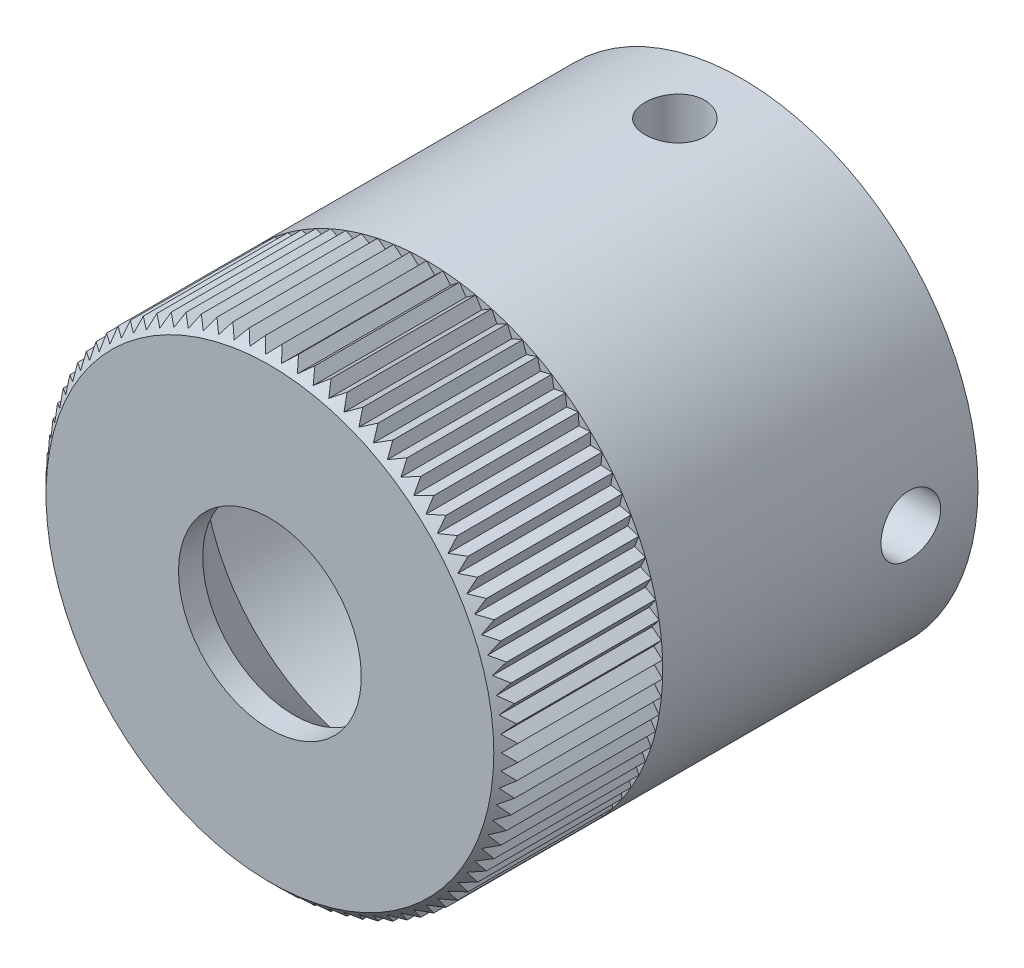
from build123d import *

# Parameters (mm, degrees)
SKETCH1_R           = 6.325
BOSS_EXTRUDE1_DEPTH = 12.65
SKETCH2_R           = 4.8
CUT_EXTRUDE1_DEPTH  = 9.65
SKETCH3_R           = 2.45
CUT_EXTRUDE2_DEPTH  = 14.158029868
CUT_EXTRUDE4_DEPTH  = 4.2
CIRPATTERN1_COUNT   = 90
CHAMFER1_SIZE       = 0.5
SKETCH6_R           = 0.8
CUT_EXTRUDE5_DEPTH  = 16.493022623
CIRPATTERN2_COUNT   = 2
CIRPATTERN2_ANGLE   = 90
SKETCH10_OUTSIDE_W  = 52.018
SKETCH10_OUTSIDE_H  = 52.018
SKETCH10_OUTSIDE_R  = 6
CUT_EXTRUDE7_DEPTH  = 16.493022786
CUT_EXTRUDE7_DRAFT  = -45


with BuildPart() as part:
    # Sketch1 → Boss-Extrude1 (new body)
    with BuildSketch(Plane.XY):
        Circle(SKETCH1_R)
    extrude(amount=BOSS_EXTRUDE1_DEPTH)

    # Sketch2 → Cut-Extrude1 (cut)
    with BuildSketch(Plane(origin=(0, 0, 0), x_dir=(-1, 0, 0), z_dir=(0, 0, -1))):
        Circle(SKETCH2_R)
    extrude(amount=-CUT_EXTRUDE1_DEPTH, mode=Mode.SUBTRACT)

    # Sketch3 → Cut-Extrude2 (cut, through all)
    with BuildSketch(Plane(origin=(0, 0, 9.65), x_dir=(-1, 0, 0), z_dir=(0, 0, -1))):
        Circle(SKETCH3_R)
    extrude(amount=-CUT_EXTRUDE2_DEPTH, mode=Mode.SUBTRACT)

    # Cut-Extrude3 cone 1 section (on through the dimple's axis) → Cut-Extrude3 (revolve, cut)
    with BuildSketch(Plane(origin=(0, 0, 9.65), x_dir=(0, 1, 0), z_dir=(1, 0, 0))):
        Polygon((0, 0), (4.8, 0), (0, 4.8), align=None)
    revolve(axis=Axis((0, 0, 9.65), (0, 0, 1)), mode=Mode.SUBTRACT)

    # Sketch5 → Cut-Extrude4 (cut)
    with BuildSketch(Plane.XY.offset(12.65)):
        with BuildLine():
            Line((0, 6.325), (0.212901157, 6.096691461))
            Line((0.212901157, 6.096691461), (0.441209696, 6.309592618))
            ThreePointArc((0.441209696, 6.309592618), (0.239203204, 6.849883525), (0, 6.325))
        make_face()
    cut_extrude4 = extrude(amount=-CUT_EXTRUDE4_DEPTH, mode=Mode.SUBTRACT)

    # CirPattern1: Cut-Extrude4 ×90 about axis
    cirpattern1_axis = Axis((0, 0, 0), (0, 0, 1))
    for i in range(1, CIRPATTERN1_COUNT):
        add(cut_extrude4.rotate(cirpattern1_axis, i * 360 / CIRPATTERN1_COUNT), mode=Mode.SUBTRACT)

    # Chamfer1
    chamfer1_edges = [part.edges().sort_by_distance(p)[0] for p in [
        (4.8, 0, 0),
    ]]
    chamfer(chamfer1_edges, length=CHAMFER1_SIZE)

    # Sketch6 → Cut-Extrude5 (cut, symmetric)
    with BuildSketch(Plane(origin=(0, 0, 0), x_dir=(0, 0, -1), z_dir=(1, 0, 0))):
        with Locations((-1.8, 0)):
            Circle(SKETCH6_R)
    cut_extrude5 = extrude(amount=CUT_EXTRUDE5_DEPTH, both=True, mode=Mode.SUBTRACT)

    # CirPattern2: Cut-Extrude5 ×2 about axis
    cirpattern2_axis = Axis((0, 0, 12.65), (0, 0, -1))
    for i in range(1, CIRPATTERN2_COUNT):
        add(cut_extrude5.rotate(cirpattern2_axis, i * CIRPATTERN2_ANGLE / (CIRPATTERN2_COUNT - 1)), mode=Mode.SUBTRACT)


with BuildPart() as cut_extrude7_tool:
    # Sketch10 outside → Cut-Extrude7 (with draft: the straight prism first)
    with BuildSketch(Plane.XY.offset(12.65)):
        Rectangle(SKETCH10_OUTSIDE_W, SKETCH10_OUTSIDE_H)
        Circle(SKETCH10_OUTSIDE_R, mode=Mode.SUBTRACT)
    extrude(amount=-CUT_EXTRUDE7_DEPTH)
    # Cut-Extrude7: the draft: its side faces are tilted about the plane it starts from
    cut_extrude7_sides = [cut_extrude7_tool.faces().sort_by_distance(p)[0] for p in [
        (0, -26.009, 4.403488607),
        (26.009, 0, 4.403488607),
        (0, 26.009, 4.403488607),
        (-26.009, 0, 4.403488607),
        (-6, 0, 4.403488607),
    ]]
    draft(cut_extrude7_sides, Plane.XY.offset(12.65), CUT_EXTRUDE7_DRAFT)


with BuildPart() as part_1:
    add(part.part)

    # Cut-Extrude7: cut by cut_extrude7_tool
    add(cut_extrude7_tool.part, mode=Mode.SUBTRACT)


solid = part_1.part
